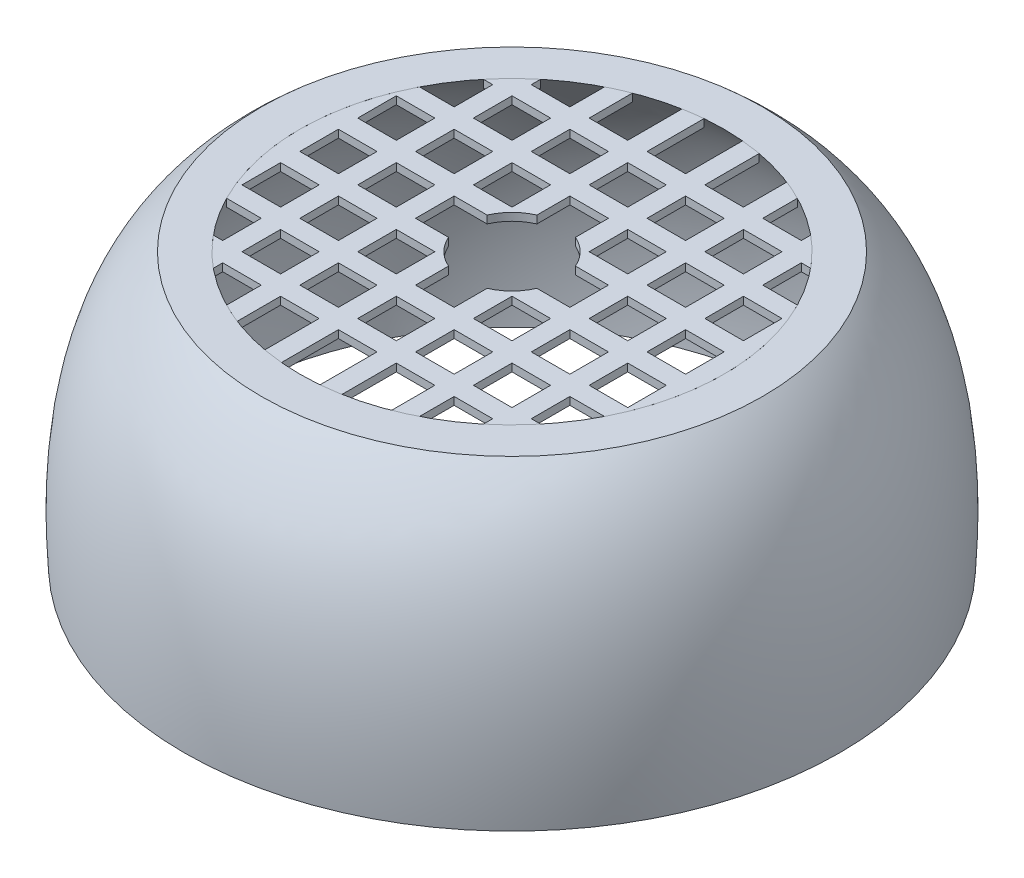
from build123d import *

# Parameters (mm, degrees)
CROQUIS3_R              = 55
SALIENTE_EXTRUIR1_DEPTH = 2
CROQUIS4_R              = 12.5
CORTAR_EXTRUIR1_DEPTH   = 2
CROQUIS5_W              = 10
CROQUIS5_H              = 10
CORTAR_EXTRUIR2_DEPTH   = 2


with BuildPart() as part:
    # Croquis2 → Revoluci_n1 (revolve)
    with BuildSketch(Plane.XY):
        with BuildLine():
            Line((-65, 70), (-55, 70))
            add(Edge.make_bspline(
                [(-75, 0), (-77.826144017, 46.451778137), (-55, 70)],
                knots=[0, 0, 0, 0.542381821, 0.542381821, 0.542381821], degree=2))
            Line((-75, 0), (-85, 0))
            add(Edge.make_bspline(
                [(-85, 0), (-88.371316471, 49.798209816), (-65, 70)],
                knots=[0, 0, 0, 0.517639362, 0.517639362, 0.517639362], degree=2))
        make_face()
    revolve(axis=Axis((0, 0, 0), (0, 1, 0)))


with BuildPart() as body_2:
    # Croquis3 → Saliente-Extruir1 (new body)
    with BuildSketch(Plane(origin=(0, 70, 0), x_dir=(1, 0, 0), z_dir=(0, 1, 0))):
        with Locations(Location((0, 0, 0), (0, 0, 270))):
            Circle(CROQUIS3_R)
    extrude(amount=-SALIENTE_EXTRUIR1_DEPTH)

    # Croquis4 → Cortar-Extruir1 (cut)
    with BuildSketch(Plane(origin=(0, 70, 0), x_dir=(1, 0, 0), z_dir=(0, 1, 0))):
        with Locations(Location((0, 0, 0), (0, 0, 270))):
            Circle(CROQUIS4_R)
    extrude(amount=-CORTAR_EXTRUIR1_DEPTH, mode=Mode.SUBTRACT)

    # Croquis5 → Cortar-Extruir2 (cut)
    with BuildSketch(Plane(origin=(0, 70, 0), x_dir=(1, 0, 0), z_dir=(0, 1, 0))):
        with Locations((-30, 30)):
            Rectangle(CROQUIS5_W, CROQUIS5_H)
        with BuildLine():
            ThreePointArc((-42.426406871, 35), (-45.980762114, 30.178958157), (-48.989794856, 25))
            Line((-48.989794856, 25), (-40, 25))
            Line((-40, 25), (-40, 35))
            Line((-40, 35), (-42.426406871, 35))
        make_face()
        with Locations((-45, 15)):
            Rectangle(CROQUIS5_W, CROQUIS5_H)
        with Locations((-30, 15)):
            Rectangle(CROQUIS5_W, CROQUIS5_H)
        with Locations((-45, 0)):
            Rectangle(CROQUIS5_W, CROQUIS5_H)
        with Locations((-30, 0)):
            Rectangle(CROQUIS5_W, CROQUIS5_H)
        with Locations((-45, -15)):
            Rectangle(CROQUIS5_W, CROQUIS5_H)
        with Locations((-30, -15)):
            Rectangle(CROQUIS5_W, CROQUIS5_H)
        with BuildLine():
            ThreePointArc((-48.989794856, -25), (-45.980762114, -30.178958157), (-42.426406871, -35))
            Line((-42.426406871, -35), (-40, -35))
            Line((-40, -35), (-40, -25))
            Line((-40, -25), (-48.989794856, -25))
        make_face()
        with Locations((-30, -30)):
            Rectangle(CROQUIS5_W, CROQUIS5_H)
        with Locations((-15, -15)):
            Rectangle(CROQUIS5_W, CROQUIS5_H)
        with BuildLine():
            Line((-20, -5), (-11.456439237, -5))
            ThreePointArc((-11.456439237, -5), (-12.5, 0), (-11.456439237, 5))
            Line((-11.456439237, 5), (-20, 5))
            Line((-20, 5), (-20, -5))
        make_face()
        with Locations((-15, 15)):
            Rectangle(CROQUIS5_W, CROQUIS5_H)
        with Locations((-15, 30)):
            Rectangle(CROQUIS5_W, CROQUIS5_H)
        with BuildLine():
            ThreePointArc((-10, 54.083269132), (-15.067465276, 52.895855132), (-20, 51.23475383))
            Line((-20, 51.23475383), (-20, 40))
            Line((-20, 40), (-10, 40))
            Line((-10, 40), (-10, 54.083269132))
        make_face()
        with BuildLine():
            ThreePointArc((-25, 48.989794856), (-30.178958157, 45.980762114), (-35, 42.426406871))
            Line((-35, 42.426406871), (-35, 40))
            Line((-35, 40), (-25, 40))
            Line((-25, 40), (-25, 48.989794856))
        make_face()
        with BuildLine():
            ThreePointArc((-35, -42.426406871), (-30.178958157, -45.980762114), (-25, -48.989794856))
            Line((-25, -48.989794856), (-25, -40))
            Line((-25, -40), (-35, -40))
            Line((-35, -40), (-35, -42.426406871))
        make_face()
        with BuildLine():
            Line((-10, -40), (-20, -40))
            Line((-20, -40), (-20, -51.23475383))
            ThreePointArc((-20, -51.23475383), (-15.067465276, -52.895855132), (-10, -54.083269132))
            Line((-10, -54.083269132), (-10, -40))
        make_face()
        with Locations((-15, -30)):
            Rectangle(CROQUIS5_W, CROQUIS5_H)
        with BuildLine():
            Line((-5, -40), (-5, -54.772255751))
            ThreePointArc((-5, -54.772255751), (-2.502591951, -54.94303444), (1.55e-07, -55))
            ThreePointArc((1.55e-07, -55), (2.502592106, -54.943034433), (5, -54.772255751))
            Line((5, -54.772255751), (5, -40))
            Line((5, -40), (-5, -40))
        make_face()
        with Locations((0, -30)):
            Rectangle(CROQUIS5_W, CROQUIS5_H)
        with BuildLine():
            ThreePointArc((5, -11.456439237), (0, -12.5), (-5, -11.456439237))
            Line((-5, -11.456439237), (-5, -20))
            Line((-5, -20), (5, -20))
            Line((5, -20), (5, -11.456439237))
        make_face()
        with BuildLine():
            Line((-5, 20), (-5, 11.456439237))
            ThreePointArc((-5, 11.456439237), (0, 12.5), (5, 11.456439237))
            Line((5, 11.456439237), (5, 20))
            Line((5, 20), (-5, 20))
        make_face()
        with Locations((0, 30)):
            Rectangle(CROQUIS5_W, CROQUIS5_H)
        with BuildLine():
            ThreePointArc((5, 54.772255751), (0, 55), (-5, 54.772255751))
            Line((-5, 54.772255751), (-5, 40))
            Line((-5, 40), (5, 40))
            Line((5, 40), (5, 54.772255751))
        make_face()
        with BuildLine():
            Line((10, -40), (10, -54.083269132))
            ThreePointArc((10, -54.083269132), (15.067465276, -52.895855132), (20, -51.23475383))
            Line((20, -51.23475383), (20, -40))
            Line((20, -40), (10, -40))
        make_face()
        with Locations((15, -30)):
            Rectangle(CROQUIS5_W, CROQUIS5_H)
        with Locations((15, -15)):
            Rectangle(CROQUIS5_W, CROQUIS5_H)
        with BuildLine():
            ThreePointArc((12.5, 0), (12.236328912, -2.553870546), (11.456439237, -5))
            Line((11.456439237, -5), (20, -5))
            Line((20, -5), (20, 5))
            Line((20, 5), (11.456439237, 5))
            ThreePointArc((11.456439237, 5), (12.236328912, 2.553870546), (12.5, 0))
        make_face()
        with Locations((15, 15)):
            Rectangle(CROQUIS5_W, CROQUIS5_H)
        with Locations((15, 30)):
            Rectangle(CROQUIS5_W, CROQUIS5_H)
        with BuildLine():
            ThreePointArc((20, 51.23475383), (15.067465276, 52.895855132), (10, 54.083269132))
            Line((10, 54.083269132), (10, 40))
            Line((10, 40), (20, 40))
            Line((20, 40), (20, 51.23475383))
        make_face()
        with BuildLine():
            Line((25, -40), (25, -48.989794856))
            ThreePointArc((25, -48.989794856), (30.178958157, -45.980762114), (35, -42.426406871))
            Line((35, -42.426406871), (35, -40))
            Line((35, -40), (25, -40))
        make_face()
        with Locations((30, -30)):
            Rectangle(CROQUIS5_W, CROQUIS5_H)
        with Locations((30, -15)):
            Rectangle(CROQUIS5_W, CROQUIS5_H)
        with Locations((30, 15)):
            Rectangle(CROQUIS5_W, CROQUIS5_H)
        with Locations((30, 30)):
            Rectangle(CROQUIS5_W, CROQUIS5_H)
        with BuildLine():
            Line((35, 40), (35, 42.426406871))
            ThreePointArc((35, 42.426406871), (30.178958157, 45.980762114), (25, 48.989794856))
            Line((25, 48.989794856), (25, 40))
            Line((25, 40), (35, 40))
        make_face()
        with BuildLine():
            Line((40, -35), (42.426406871, -35))
            ThreePointArc((42.426406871, -35), (45.980762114, -30.178958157), (48.989794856, -25))
            Line((48.989794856, -25), (40, -25))
            Line((40, -25), (40, -35))
        make_face()
        with Locations((45, -15)):
            Rectangle(CROQUIS5_W, CROQUIS5_H)
        with Locations((45, 0)):
            Rectangle(CROQUIS5_W, CROQUIS5_H)
        with Locations((45, 15)):
            Rectangle(CROQUIS5_W, CROQUIS5_H)
        with BuildLine():
            Line((40, 25), (48.989794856, 25))
            ThreePointArc((48.989794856, 25), (45.980762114, 30.178958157), (42.426406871, 35))
            Line((42.426406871, 35), (40, 35))
            Line((40, 35), (40, 25))
        make_face()
        with Locations((30, 0)):
            Rectangle(CROQUIS5_W, CROQUIS5_H)
    extrude(amount=-CORTAR_EXTRUIR2_DEPTH, mode=Mode.SUBTRACT)


solid = Compound([part.part, body_2.part])
